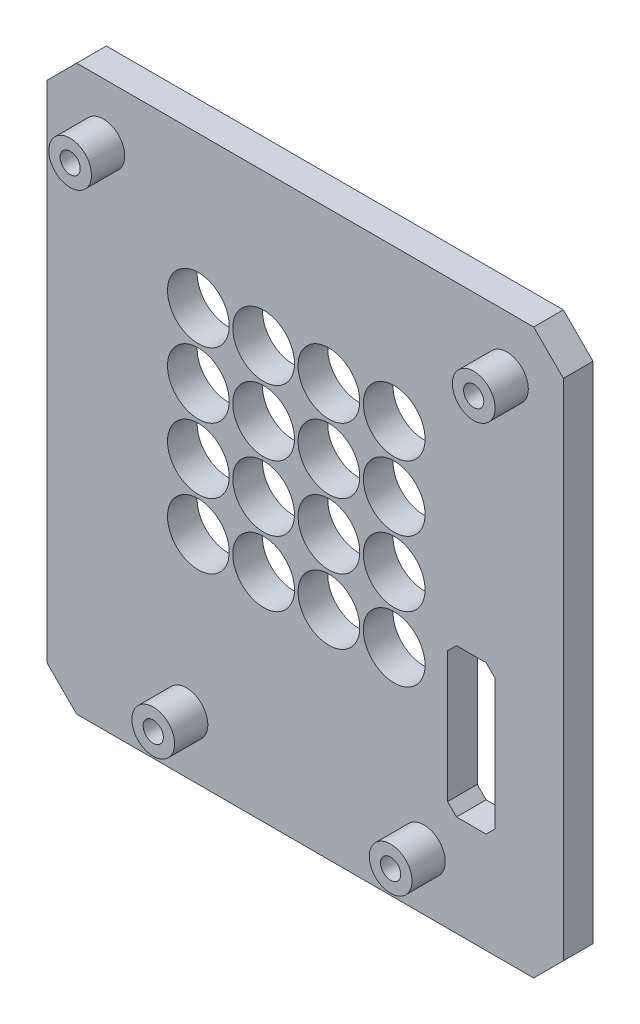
from build123d import *

# Parameters (mm, degrees)
SKETCH_1_R                                     = 5.2
SKETCH_1_R_2                                   = 1.7
GUIDE_16_THROUGH_BORES_AND_R2_R16_WINDOW_DEPTH = 5
PCB_FRONT_DATUM_10P6_START                     = 5
SKETCH_2_R                                     = 3.6
SKETCH_2_R_2                                   = 1.7
PCB_FRONT_DATUM_10P6_DEPTH                     = 5.6


with BuildPart() as part:
    # Sketch 1 → Guide_16_THROUGH_bores_and_R2_R16_window (new body)
    with BuildSketch(Plane.XY):
        Polygon((-37, -53), (40, -53), (45, -48), (45, 37), (40, 42), (-37, 42), (-42, 37), (-42, -48), align=None)
        with Locations((-16.5, -16.5)):
            Circle(SKETCH_1_R, mode=Mode.SUBTRACT)
        with Locations((-5.5, -16.5)):
            Circle(SKETCH_1_R, mode=Mode.SUBTRACT)
        with Locations((5.5, -16.5)):
            Circle(SKETCH_1_R, mode=Mode.SUBTRACT)
        with Locations((16.5, -16.5)):
            Circle(SKETCH_1_R, mode=Mode.SUBTRACT)
        with Locations((-16.5, -5.5)):
            Circle(SKETCH_1_R, mode=Mode.SUBTRACT)
        with Locations((-5.5, -5.5)):
            Circle(SKETCH_1_R, mode=Mode.SUBTRACT)
        with Locations((5.5, -5.5)):
            Circle(SKETCH_1_R, mode=Mode.SUBTRACT)
        with Locations((16.5, -5.5)):
            Circle(SKETCH_1_R, mode=Mode.SUBTRACT)
        with Locations((-16.5, 5.5)):
            Circle(SKETCH_1_R, mode=Mode.SUBTRACT)
        with Locations((-5.5, 5.5)):
            Circle(SKETCH_1_R, mode=Mode.SUBTRACT)
        with Locations((5.5, 5.5)):
            Circle(SKETCH_1_R, mode=Mode.SUBTRACT)
        with Locations((16.5, 5.5)):
            Circle(SKETCH_1_R, mode=Mode.SUBTRACT)
        with Locations((-16.5, 16.5)):
            Circle(SKETCH_1_R, mode=Mode.SUBTRACT)
        with Locations((-5.5, 16.5)):
            Circle(SKETCH_1_R, mode=Mode.SUBTRACT)
        with Locations((5.5, 16.5)):
            Circle(SKETCH_1_R, mode=Mode.SUBTRACT)
        with Locations((16.5, 16.5)):
            Circle(SKETCH_1_R, mode=Mode.SUBTRACT)
        with Locations((-32.5, 32.5)):
            Circle(SKETCH_1_R_2, mode=Mode.SUBTRACT)
        with Locations((35.5, 32.5)):
            Circle(SKETCH_1_R_2, mode=Mode.SUBTRACT)
        with Locations((-18.5, -43.5)):
            Circle(SKETCH_1_R_2, mode=Mode.SUBTRACT)
        with Locations((21.5, -43.5)):
            Circle(SKETCH_1_R_2, mode=Mode.SUBTRACT)
        Polygon((27, -36), (32, -36), (33.5, -34.5), (33.5, -12.5), (32, -11), (27, -11), (25.5, -12.5), (25.5, -34.5), align=None, mode=Mode.SUBTRACT)
    extrude(amount=GUIDE_16_THROUGH_BORES_AND_R2_R16_WINDOW_DEPTH)

    # Sketch 2 → PCB_front_datum_10p6 (add)
    # profile 1 of 4: a face of its own
    with BuildSketch(Plane.XY.offset(PCB_FRONT_DATUM_10P6_START)):
        with Locations((-32.5, 32.5)):
            Circle(SKETCH_2_R)
        with Locations((-32.5, 32.5)):
            Circle(SKETCH_2_R_2, mode=Mode.SUBTRACT)
    # profile 2 of 4: a face of its own
    with BuildSketch(Plane.XY.offset(PCB_FRONT_DATUM_10P6_START)):
        with Locations((35.5, 32.5)):
            Circle(SKETCH_2_R)
        with Locations((35.5, 32.5)):
            Circle(SKETCH_2_R_2, mode=Mode.SUBTRACT)
    # profile 3 of 4: a face of its own
    with BuildSketch(Plane.XY.offset(PCB_FRONT_DATUM_10P6_START)):
        with Locations((-18.5, -43.5)):
            Circle(SKETCH_2_R)
        with Locations((-18.5, -43.5)):
            Circle(SKETCH_2_R_2, mode=Mode.SUBTRACT)
    # profile 4 of 4: a face of its own
    with BuildSketch(Plane.XY.offset(PCB_FRONT_DATUM_10P6_START)):
        with Locations((21.5, -43.5)):
            Circle(SKETCH_2_R)
        with Locations((21.5, -43.5)):
            Circle(SKETCH_2_R_2, mode=Mode.SUBTRACT)
    extrude(amount=PCB_FRONT_DATUM_10P6_DEPTH)


solid = part.part
